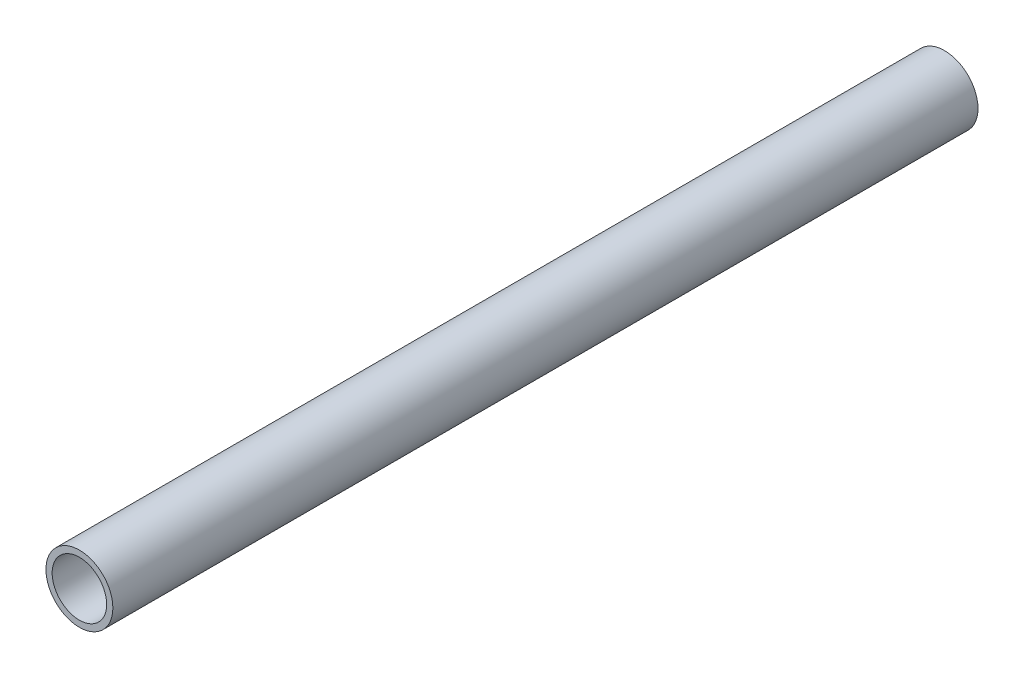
from build123d import *

# Parameters (mm, degrees)
SKETCH1_R          = 7.9375
SKETCH1_R_2        = 6.4643
BASE_EXTRUDE_DEPTH = 205.232


with BuildPart() as part:
    # Sketch1 → Base-Extrude (new body)
    with BuildSketch(Plane.XY):
        Circle(SKETCH1_R)
        Circle(SKETCH1_R_2, mode=Mode.SUBTRACT)
    extrude(amount=-BASE_EXTRUDE_DEPTH)


solid = part.part
